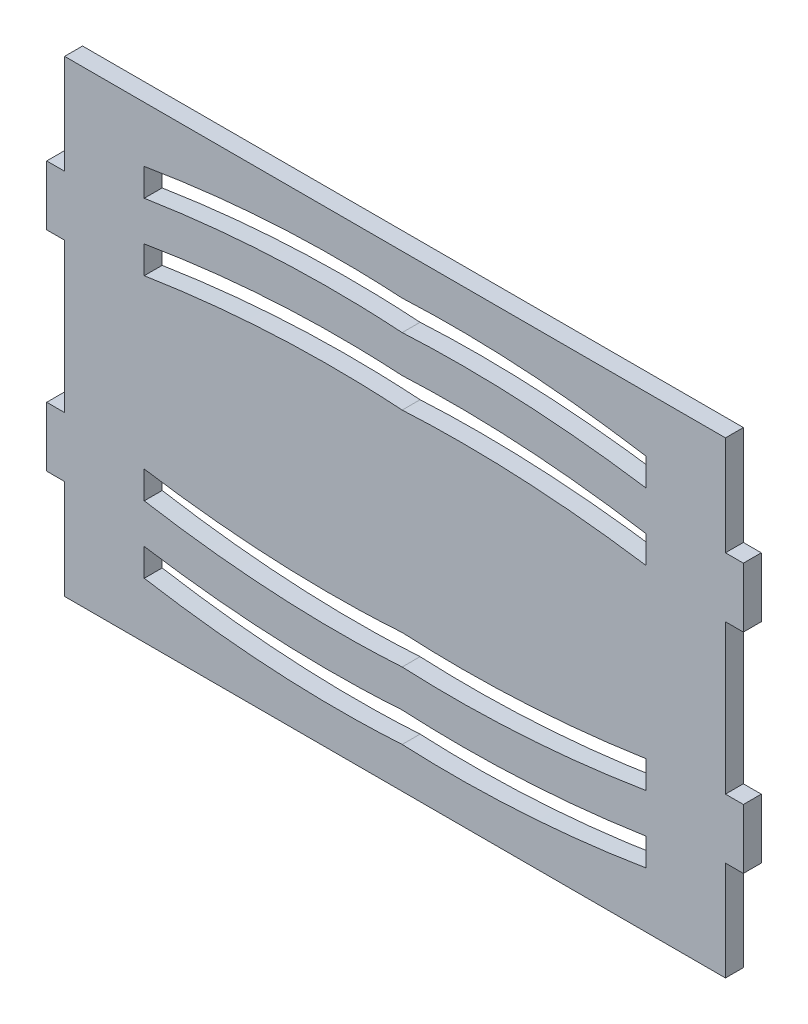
from build123d import *

# Parameters (mm, degrees)
SKETCH1_W               = 684
SKETCH1_H               = 470
BOSS_EXTRUDE1_DEPTH     = 18
CUT_EXTRUDE1_DEPTH      = 416.346843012
CUT_EXTRUDE1_DEPTH_BACK = 18
SKETCH3_W               = 10
SKETCH3_H               = 100
SKETCH3_H_2             = 150
CUT_EXTRUDE5_DEPTH      = 18
SKETCH9_W               = 8
SKETCH9_H               = 60
BOSS_EXTRUDE2_DEPTH     = 18


with BuildPart() as part:
    # Sketch1 → Boss-Extrude1 (new body)
    with BuildSketch(Plane.XY):
        Rectangle(SKETCH1_W, SKETCH1_H)
    extrude(amount=BOSS_EXTRUDE1_DEPTH)

    # Sketch2 → Cut-Extrude1 (cut, two sides: drawn at the far end of the back side and taken through both)
    with BuildSketch(Plane.XY.offset(-CUT_EXTRUDE1_DEPTH_BACK)):
        with BuildLine():
            Line((-252, 179.190004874), (-252, 151.506631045))
            add(Edge.make_bspline(
                [(-252, 151.506631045), (-117.966189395, 172.594893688), (7.160934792, 164.190004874)],
                knots=[0, 0, 0, 0.510888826, 0.510888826, 0.510888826], degree=2))
            add(Edge.make_bspline(
                [(252, 151.506631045), (125.340212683, 170.58511885), (7.160934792, 164.190004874)],
                knots=[0, 0, 0, 0.482140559, 0.482140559, 0.482140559], degree=2))
            Line((252, 151.506631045), (252, 179.190004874))
            add(Edge.make_bspline(
                [(252, 179.190004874), (125.388311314, 199.900069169), (7.160934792, 194.190004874)],
                knots=[0, 0, 0, 0.482354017, 0.482354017, 0.482354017], degree=2))
            add(Edge.make_bspline(
                [(-252, 179.190004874), (-118.0183651, 201.925959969), (7.160934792, 194.190004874)],
                knots=[0, 0, 0, 0.511095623, 0.511095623, 0.511095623], degree=2))
        make_face()
        with BuildLine():
            Line((-252, 111.790004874), (-252, 84.106631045))
            add(Edge.make_bspline(
                [(-252, 84.106631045), (-117.966189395, 105.194893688), (7.160934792, 96.790004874)],
                knots=[0, 0, 0, 0.510888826, 0.510888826, 0.510888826], degree=2))
            add(Edge.make_bspline(
                [(252, 84.106631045), (125.340212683, 103.18511885), (7.160934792, 96.790004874)],
                knots=[0, 0, 0, 0.482140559, 0.482140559, 0.482140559], degree=2))
            Line((252, 84.106631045), (252, 111.790004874))
            add(Edge.make_bspline(
                [(252, 111.790004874), (125.388311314, 132.500069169), (7.160934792, 126.790004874)],
                knots=[0, 0, 0, 0.482354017, 0.482354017, 0.482354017], degree=2))
            add(Edge.make_bspline(
                [(-252, 111.790004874), (-118.0183651, 134.525959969), (7.160934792, 126.790004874)],
                knots=[0, 0, 0, 0.511095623, 0.511095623, 0.511095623], degree=2))
        make_face()
        with BuildLine():
            Line((252, -179.190004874), (252, -151.506631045))
            add(Edge.make_bspline(
                [(252, -151.506631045), (125.340212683, -170.58511885), (7.160934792, -164.190004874)],
                knots=[0, 0, 0, 0.482140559, 0.482140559, 0.482140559], degree=2))
            add(Edge.make_bspline(
                [(-252, -151.506631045), (-117.966189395, -172.594893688), (7.160934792, -164.190004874)],
                knots=[0, 0, 0, 0.510888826, 0.510888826, 0.510888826], degree=2))
            Line((-252, -151.506631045), (-252, -179.190004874))
            add(Edge.make_bspline(
                [(-252, -179.190004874), (-118.0183651, -201.925959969), (7.160934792, -194.190004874)],
                knots=[0, 0, 0, 0.511095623, 0.511095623, 0.511095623], degree=2))
            add(Edge.make_bspline(
                [(252, -179.190004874), (125.388311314, -199.900069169), (7.160934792, -194.190004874)],
                knots=[0, 0, 0, 0.482354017, 0.482354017, 0.482354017], degree=2))
        make_face()
        with BuildLine():
            Line((-252, -111.790004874), (-252, -84.106631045))
            add(Edge.make_bspline(
                [(-252, -84.106631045), (-117.966189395, -105.194893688), (7.160934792, -96.790004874)],
                knots=[0, 0, 0, 0.510888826, 0.510888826, 0.510888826], degree=2))
            add(Edge.make_bspline(
                [(252, -84.106631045), (125.340212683, -103.18511885), (7.160934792, -96.790004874)],
                knots=[0, 0, 0, 0.482140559, 0.482140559, 0.482140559], degree=2))
            Line((252, -84.106631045), (252, -111.790004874))
            add(Edge.make_bspline(
                [(252, -111.790004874), (125.388311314, -132.500069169), (7.160934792, -126.790004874)],
                knots=[0, 0, 0, 0.482354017, 0.482354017, 0.482354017], degree=2))
            add(Edge.make_bspline(
                [(-252, -111.790004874), (-118.0183651, -134.525959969), (7.160934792, -126.790004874)],
                knots=[0, 0, 0, 0.511095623, 0.511095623, 0.511095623], degree=2))
        make_face()
    extrude(amount=CUT_EXTRUDE1_DEPTH + CUT_EXTRUDE1_DEPTH_BACK, mode=Mode.SUBTRACT)

    # Sketch3 → Cut-Extrude5 (cut)
    with BuildSketch(Plane.XY):
        with Locations((337, -185)):
            Rectangle(SKETCH3_W, SKETCH3_H)
        with Locations((337, 0)):
            Rectangle(SKETCH3_W, SKETCH3_H_2)
        with Locations((337, 185)):
            Rectangle(SKETCH3_W, SKETCH3_H)
        with Locations((-337, 0)):
            Rectangle(SKETCH3_W, SKETCH3_H_2)
        with Locations((-337, 185)):
            Rectangle(SKETCH3_W, SKETCH3_H)
        with Locations((-337, -185)):
            Rectangle(SKETCH3_W, SKETCH3_H)
    extrude(amount=CUT_EXTRUDE5_DEPTH, mode=Mode.SUBTRACT)

    # Sketch9 → Boss-Extrude2 (add)
    with BuildSketch(Plane.XY):
        with Locations((-346, 105)):
            Rectangle(SKETCH9_W, SKETCH9_H)
        with Locations((-346, -105)):
            Rectangle(SKETCH9_W, SKETCH9_H)
        with Locations((346, 105)):
            Rectangle(SKETCH9_W, SKETCH9_H)
        with Locations((346, -105)):
            Rectangle(SKETCH9_W, SKETCH9_H)
    extrude(amount=BOSS_EXTRUDE2_DEPTH)


solid = part.part
